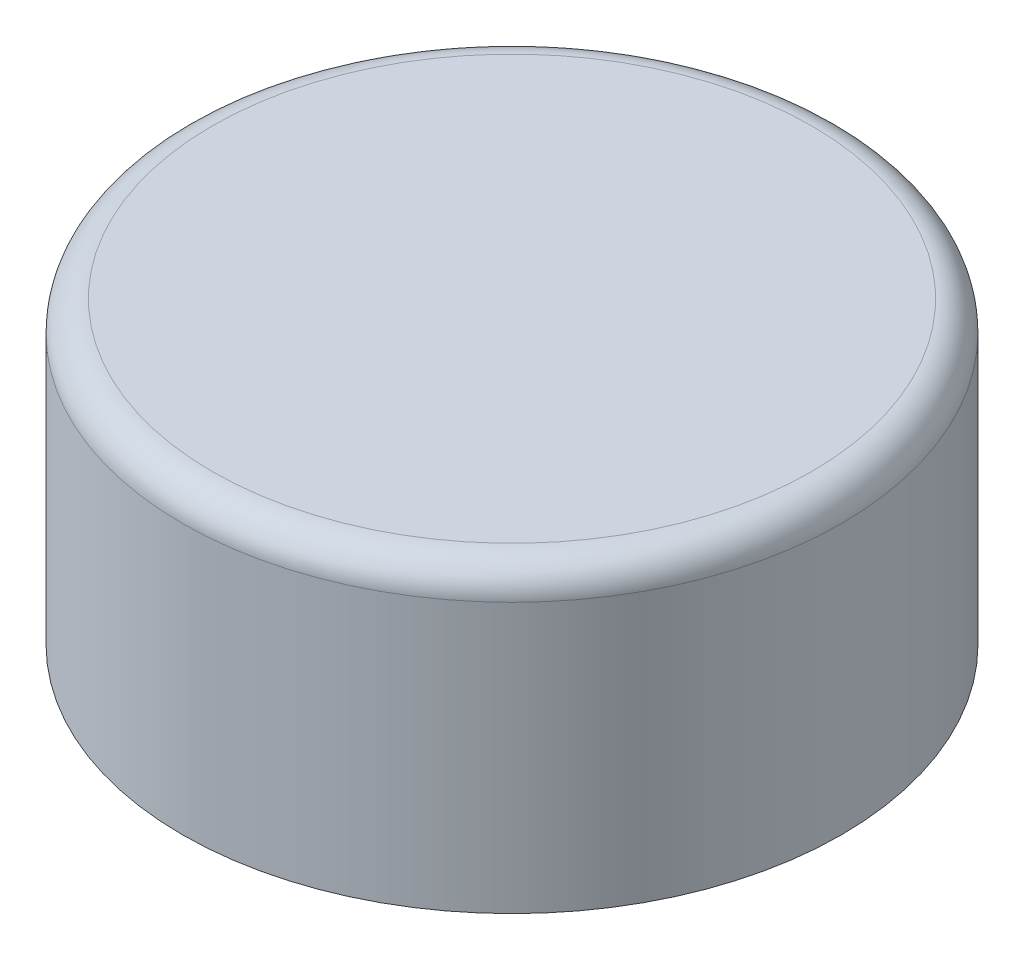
from build123d import *


with BuildPart() as part:
    # Esquisse1 → R_volution1 (revolve)
    with BuildSketch(Plane.XY, mode=Mode.PRIVATE) as r_volution1_sk:
        with BuildLine():
            Line((0, 0), (-13.2, 0))
            Line((-13.2, 0), (-13.2, 10.8))
            ThreePointArc((-13.2, 10.8), (-12.848528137, 11.648528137), (-12, 12))
            Line((-12, 12), (0, 12))
            Line((0, 12), (0, 0))
        make_face()
    revolve(r_volution1_sk.sketch.rotate(Axis((0, 0, 0), (0, 1, 0)), 270), axis=Axis((0, 0, 0), (0, 1, 0)))


solid = part.part
